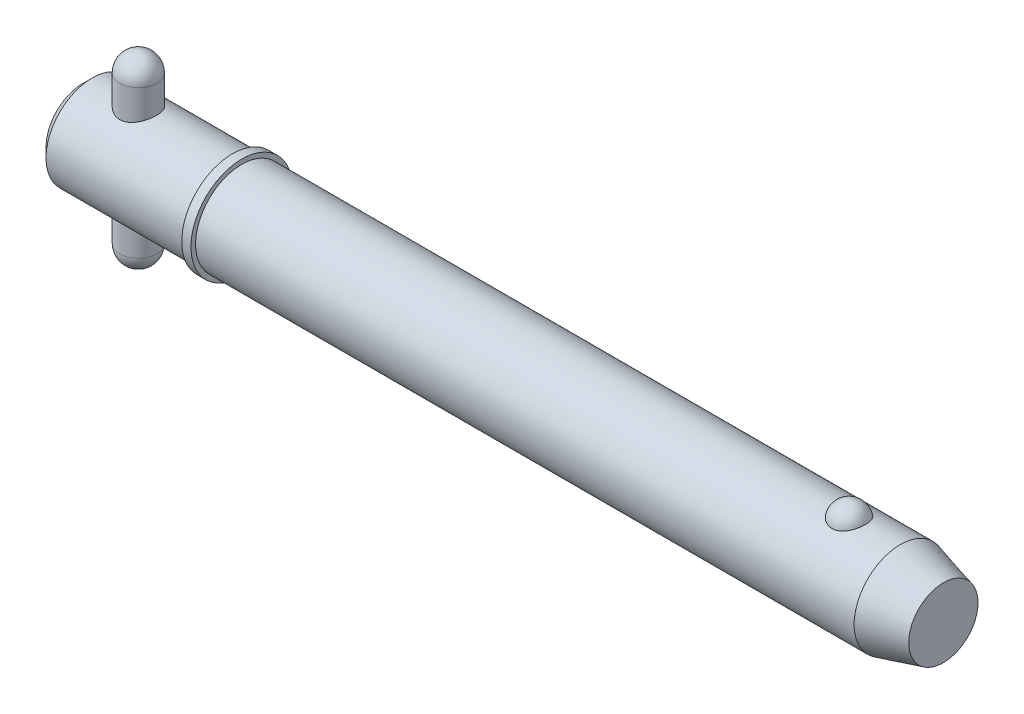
ISO-10303-21;
HEADER;
FILE_DESCRIPTION(('STEP AP214'),'2;1');
FILE_NAME('part.step','',(''),(''),'','','');
FILE_SCHEMA(('AUTOMOTIVE_DESIGN { 1 0 10303 214 1 1 1 1 }'));
ENDSEC;
DATA;
#1=APPLICATION_CONTEXT('core data for automotive mechanical design processes');
#2=APPLICATION_PROTOCOL_DEFINITION('international standard','automotive_design',2000,#1);
#3=PRODUCT_CONTEXT('',#1,'mechanical');
#4=PRODUCT('Part','Part','',(#3));
#5=PRODUCT_RELATED_PRODUCT_CATEGORY('part','',(#4));
#6=PRODUCT_DEFINITION_FORMATION('','',#4);
#7=PRODUCT_DEFINITION_CONTEXT('part definition',#1,'design');
#8=PRODUCT_DEFINITION('design','',#6,#7);
#9=PRODUCT_DEFINITION_SHAPE('','',#8);
#10=(LENGTH_UNIT() NAMED_UNIT(*) SI_UNIT(.MILLI.,.METRE.));
#11=(NAMED_UNIT(*) PLANE_ANGLE_UNIT() SI_UNIT($,.RADIAN.));
#12=(NAMED_UNIT(*) SI_UNIT($,.STERADIAN.) SOLID_ANGLE_UNIT());
#13=UNCERTAINTY_MEASURE_WITH_UNIT(LENGTH_MEASURE(1.E-05),#10,'distance_accuracy_value','');
#14=(GEOMETRIC_REPRESENTATION_CONTEXT(3) GLOBAL_UNCERTAINTY_ASSIGNED_CONTEXT((#13)) GLOBAL_UNIT_ASSIGNED_CONTEXT((#10,
#11,#12)) REPRESENTATION_CONTEXT('',''));
#15=CARTESIAN_POINT('',(0.,0.,0.));
#16=DIRECTION('',(0.,0.,1.));
#17=DIRECTION('',(1.,0.,0.));
#18=AXIS2_PLACEMENT_3D('',#15,#16,#17);
#19=CARTESIAN_POINT('',(9.525,15.875,0.));
#20=DIRECTION('',(0.,-1.,0.));
#21=DIRECTION('',(0.,0.,-1.));
#22=AXIS2_PLACEMENT_3D('',#19,#20,#21);
#23=CYLINDRICAL_SURFACE('',#22,3.175);
#24=CARTESIAN_POINT('',(9.525,-12.7,0.));
#25=DIRECTION('',(0.,-1.,0.));
#26=DIRECTION('',(0.,0.,-1.));
#27=AXIS2_PLACEMENT_3D('',#24,#25,#26);
#28=CIRCLE('',#27,3.175);
#29=CARTESIAN_POINT('',(9.525,-12.7,-3.175));
#30=VERTEX_POINT('',#29);
#31=EDGE_CURVE('P0_E10',#30,#30,#28,.F.);
#32=ORIENTED_EDGE('',*,*,#31,.T.);
#33=EDGE_LOOP('',(#32));
#34=FACE_BOUND('',#33,.T.);
#35=CARTESIAN_POINT('',(9.525,12.7,0.));
#36=DIRECTION('',(0.,-1.,0.));
#37=DIRECTION('',(0.,0.,-1.));
#38=AXIS2_PLACEMENT_3D('',#35,#36,#37);
#39=CIRCLE('',#38,3.175);
#40=CARTESIAN_POINT('',(9.525,12.7,-3.175));
#41=VERTEX_POINT('',#40);
#42=EDGE_CURVE('P0_E21',#41,#41,#39,.T.);
#43=ORIENTED_EDGE('',*,*,#42,.T.);
#44=EDGE_LOOP('',(#43));
#45=FACE_BOUND('',#44,.T.);
#46=ADVANCED_FACE('P0_F14',(#34,#45),#23,.T.);
#47=CARTESIAN_POINT('',(9.525,-12.7,0.));
#48=DIRECTION('',(0.,0.,1.));
#49=DIRECTION('',(1.,0.,0.));
#50=AXIS2_PLACEMENT_3D('',#47,#48,#49);
#51=SPHERICAL_SURFACE('',#50,3.175);
#52=CARTESIAN_POINT('',(9.525,-12.7,0.));
#53=DIRECTION('',(0.,-1.,0.));
#54=DIRECTION('',(0.,0.,-1.));
#55=AXIS2_PLACEMENT_3D('',#52,#53,#54);
#56=SPHERICAL_SURFACE('',#55,3.175);
#57=ORIENTED_EDGE('',*,*,#31,.F.);
#58=EDGE_LOOP('',(#57));
#59=FACE_BOUND('',#58,.T.);
#60=ADVANCED_FACE('P0_F29',(#59),#56,.T.);
#61=CARTESIAN_POINT('',(9.525,12.7,0.));
#62=DIRECTION('',(0.,0.,1.));
#63=DIRECTION('',(1.,0.,0.));
#64=AXIS2_PLACEMENT_3D('',#61,#62,#63);
#65=SPHERICAL_SURFACE('',#64,3.175);
#66=CARTESIAN_POINT('',(9.525,12.7,0.));
#67=DIRECTION('',(0.,-1.,0.));
#68=DIRECTION('',(0.,0.,-1.));
#69=AXIS2_PLACEMENT_3D('',#66,#67,#68);
#70=SPHERICAL_SURFACE('',#69,3.175);
#71=ORIENTED_EDGE('',*,*,#42,.F.);
#72=EDGE_LOOP('',(#71));
#73=FACE_BOUND('',#72,.T.);
#74=ADVANCED_FACE('P0_F16',(#73),#70,.T.);
#75=CLOSED_SHELL('',(#46,#60,#74));
#76=MANIFOLD_SOLID_BREP('P0_B1',#75);
#77=CARTESIAN_POINT('',(0.,0.,0.));
#78=DIRECTION('',(1.,0.,0.));
#79=DIRECTION('',(0.,0.,-1.));
#80=AXIS2_PLACEMENT_3D('',#77,#78,#79);
#81=CYLINDRICAL_SURFACE('',#80,7.94);
#82=CARTESIAN_POINT('',(140.551879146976,0.,0.));
#83=DIRECTION('',(1.,0.,0.));
#84=DIRECTION('',(0.,0.,-1.));
#85=AXIS2_PLACEMENT_3D('',#82,#83,#84);
#86=CIRCLE('',#85,7.94);
#87=CARTESIAN_POINT('',(140.551879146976,0.,-7.94));
#88=VERTEX_POINT('',#87);
#89=EDGE_CURVE('P1_E81',#88,#88,#86,.T.);
#90=ORIENTED_EDGE('',*,*,#89,.F.);
#91=EDGE_LOOP('',(#90));
#92=FACE_BOUND('',#91,.T.);
#93=CARTESIAN_POINT('',(27.31,0.,0.));
#94=DIRECTION('',(1.,0.,0.));
#95=DIRECTION('',(0.,0.,-1.));
#96=AXIS2_PLACEMENT_3D('',#93,#94,#95);
#97=CIRCLE('',#96,7.94);
#98=CARTESIAN_POINT('',(27.31,0.,-7.94));
#99=VERTEX_POINT('',#98);
#100=EDGE_CURVE('P1_E85',#99,#99,#97,.T.);
#101=ORIENTED_EDGE('',*,*,#100,.T.);
#102=EDGE_LOOP('',(#101));
#103=FACE_BOUND('',#102,.T.);
#104=CARTESIAN_POINT('',(131.744907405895,7.37767842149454,2.93486986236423));
#105=CARTESIAN_POINT('',(131.592749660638,7.3776732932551,2.93487505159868));
#106=CARTESIAN_POINT('',(131.440632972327,7.38258419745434,2.92262454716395));
#107=CARTESIAN_POINT('',(131.140928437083,7.40163229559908,2.87404196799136));
#108=CARTESIAN_POINT('',(130.993339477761,7.41576720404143,2.83771585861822));
#109=CARTESIAN_POINT('',(130.707018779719,7.45161576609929,2.74218769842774));
#110=CARTESIAN_POINT('',(130.568274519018,7.47331841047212,2.68301886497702));
#111=CARTESIAN_POINT('',(130.302882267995,7.52194082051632,2.54350967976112));
#112=CARTESIAN_POINT('',(130.176236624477,7.54886159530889,2.46316523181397));
#113=CARTESIAN_POINT('',(129.934534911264,7.60594671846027,2.28090375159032));
#114=CARTESIAN_POINT('',(129.819906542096,7.63618114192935,2.1784421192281));
#115=CARTESIAN_POINT('',(129.608878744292,7.69614046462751,1.95608495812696));
#116=CARTESIAN_POINT('',(129.512482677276,7.72586526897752,1.83618622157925));
#117=CARTESIAN_POINT('',(129.335938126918,7.78314821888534,1.57628086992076));
#118=CARTESIAN_POINT('',(129.256707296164,7.81055035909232,1.43561546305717));
#119=CARTESIAN_POINT('',(129.121797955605,7.85879631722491,1.14236334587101));
#120=CARTESIAN_POINT('',(129.066121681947,7.87963951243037,0.989775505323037));
#121=CARTESIAN_POINT('',(128.97881215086,7.91289645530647,0.674619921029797));
#122=CARTESIAN_POINT('',(128.94753090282,7.92518652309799,0.511941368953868));
#123=CARTESIAN_POINT('',(128.910975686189,7.93958930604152,0.183247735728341));
#124=CARTESIAN_POINT('',(128.905701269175,7.94170219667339,0.0172327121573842));
#125=CARTESIAN_POINT('',(128.921231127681,7.93554931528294,-0.312672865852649));
#126=CARTESIAN_POINT('',(128.941925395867,7.92732732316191,-0.476569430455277));
#127=CARTESIAN_POINT('',(129.00878655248,7.90141534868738,-0.79830524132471));
#128=CARTESIAN_POINT('',(129.054953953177,7.88372517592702,-0.956144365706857));
#129=CARTESIAN_POINT('',(129.171898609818,7.84066230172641,-1.26152073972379));
#130=CARTESIAN_POINT('',(129.242704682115,7.81528060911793,-1.40904568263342));
#131=CARTESIAN_POINT('',(129.407478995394,7.75948672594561,-1.68950598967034));
#132=CARTESIAN_POINT('',(129.501448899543,7.72907417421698,-1.82244030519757));
#133=CARTESIAN_POINT('',(129.710839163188,7.66640424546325,-2.07032792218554));
#134=CARTESIAN_POINT('',(129.826315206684,7.63414223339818,-2.18523308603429));
#135=CARTESIAN_POINT('',(130.0759006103,7.57149681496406,-2.39329737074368));
#136=CARTESIAN_POINT('',(130.210008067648,7.54111321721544,-2.48645870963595));
#137=CARTESIAN_POINT('',(130.490111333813,7.48650742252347,-2.64628132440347));
#138=CARTESIAN_POINT('',(130.635760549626,7.46215900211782,-2.71350554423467));
#139=CARTESIAN_POINT('',(130.937425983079,7.42171253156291,-2.82226614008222));
#140=CARTESIAN_POINT('',(131.093438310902,7.40561140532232,-2.86381209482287));
#141=CARTESIAN_POINT('',(131.402970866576,7.3842679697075,-2.9183907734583));
#142=CARTESIAN_POINT('',(131.556222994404,7.37852109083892,-2.93275024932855));
#143=CARTESIAN_POINT('',(131.863070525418,7.37700973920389,-2.93655208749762));
#144=CARTESIAN_POINT('',(132.016665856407,7.38124333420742,-2.92599927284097));
#145=CARTESIAN_POINT('',(132.314990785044,7.39890635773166,-2.88102897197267));
#146=CARTESIAN_POINT('',(132.459848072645,7.41205491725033,-2.84733999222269));
#147=CARTESIAN_POINT('',(132.74164329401,7.445801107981,-2.75788206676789));
#148=CARTESIAN_POINT('',(132.878580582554,7.46639934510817,-2.70211132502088));
#149=CARTESIAN_POINT('',(133.144061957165,7.51339098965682,-2.56858908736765));
#150=CARTESIAN_POINT('',(133.272354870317,7.53990200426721,-2.4903806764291));
#151=CARTESIAN_POINT('',(133.514244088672,7.59569503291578,-2.31462737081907));
#152=CARTESIAN_POINT('',(133.627837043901,7.6249776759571,-2.21707808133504));
#153=CARTESIAN_POINT('',(133.84322156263,7.68489473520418,-1.99982049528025));
#154=CARTESIAN_POINT('',(133.944148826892,7.71552419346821,-1.87925337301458));
#155=CARTESIAN_POINT('',(134.125186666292,7.77353016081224,-1.6226882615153));
#156=CARTESIAN_POINT('',(134.205293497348,7.80090608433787,-1.48668750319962));
#157=CARTESIAN_POINT('',(134.345361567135,7.85047992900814,-1.1981841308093));
#158=CARTESIAN_POINT('',(134.404587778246,7.87248183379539,-1.04529016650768));
#159=CARTESIAN_POINT('',(134.497982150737,7.90785114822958,-0.731080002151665));
#160=CARTESIAN_POINT('',(134.532149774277,7.92121837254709,-0.569763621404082));
#161=CARTESIAN_POINT('',(134.574795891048,7.93797834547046,-0.242812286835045));
#162=CARTESIAN_POINT('',(134.583204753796,7.94134405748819,-0.0771668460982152));
#163=CARTESIAN_POINT('',(134.573962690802,7.93767937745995,0.253276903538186));
#164=CARTESIAN_POINT('',(134.556312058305,7.93064910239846,0.418075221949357));
#165=CARTESIAN_POINT('',(134.495424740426,7.90695571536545,0.741525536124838));
#166=CARTESIAN_POINT('',(134.452281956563,7.8903279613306,0.900197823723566));
#167=CARTESIAN_POINT('',(134.34135358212,7.84916386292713,1.20759654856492));
#168=CARTESIAN_POINT('',(134.27356656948,7.82462706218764,1.35632241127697));
#169=CARTESIAN_POINT('',(134.114371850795,7.77006699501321,1.64032869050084));
#170=CARTESIAN_POINT('',(134.022861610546,7.74002008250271,1.7755471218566));
#171=CARTESIAN_POINT('',(133.818296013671,7.67774175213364,2.0280064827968));
#172=CARTESIAN_POINT('',(133.705241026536,7.64551037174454,2.14524772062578));
#173=CARTESIAN_POINT('',(133.460831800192,7.58265895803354,2.35778002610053));
#174=CARTESIAN_POINT('',(133.329583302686,7.5520309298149,2.45319004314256));
#175=CARTESIAN_POINT('',(133.051601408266,7.49579792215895,2.61999897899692));
#176=CARTESIAN_POINT('',(132.904867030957,7.4701932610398,2.69139637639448));
#177=CARTESIAN_POINT('',(132.592947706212,7.42622216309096,2.8105324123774));
#178=CARTESIAN_POINT('',(132.427220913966,7.40825002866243,2.85700910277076));
#179=CARTESIAN_POINT('',(132.089279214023,7.38398348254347,2.9191685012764));
#180=CARTESIAN_POINT('',(131.91706702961,7.3776842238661,2.93486399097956));
#181=CARTESIAN_POINT('',(131.744907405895,7.37767842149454,2.93486986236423));
#182=B_SPLINE_CURVE_WITH_KNOTS('',3,(#104,#105,#106,#107,#108,#109,#110,#111,#112,#113,#114,
#115,#116,#117,#118,#119,#120,#121,#122,#123,#124,#125,#126,#127,#128,#129,#130,#131,#132,#133,
#134,#135,#136,#137,#138,#139,#140,#141,#142,#143,#144,#145,#146,#147,#148,#149,#150,#151,#152,
#153,#154,#155,#156,#157,#158,#159,#160,#161,#162,#163,#164,#165,#166,#167,#168,#169,#170,#171,
#172,#173,#174,#175,#176,#177,#178,#179,#180,#181),.UNSPECIFIED.,.T.,.F.,(4,2,2,2,2,2,2,2,2,2,2,
2,2,2,2,2,2,2,2,2,2,2,2,2,2,2,2,2,2,2,2,2,2,2,2,2,2,2,4),(0.,0.455841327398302,
0.911569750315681,1.36663794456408,1.82179423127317,2.2897898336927,2.75787163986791,
3.24685368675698,3.73588214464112,4.23184282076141,4.72779494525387,5.22165321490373,
5.71552141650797,6.20996917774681,6.7044524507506,7.20023431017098,7.69596557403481,
8.18023418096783,8.66432203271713,9.12410697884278,9.58380291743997,10.0296503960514,
10.4755341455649,10.9312349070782,11.3870393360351,11.8654416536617,12.3439299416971,
12.8378875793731,13.3318558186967,13.8271581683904,14.3224549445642,14.8159385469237,
15.3094506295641,15.8051323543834,16.3008055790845,16.7937101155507,17.2866458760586,
17.8026240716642,18.3183879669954),.UNSPECIFIED.);
#183=CARTESIAN_POINT('',(131.744907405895,7.37767842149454,2.93486986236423));
#184=VERTEX_POINT('',#183);
#185=EDGE_CURVE('P1_E35',#184,#184,#182,.T.);
#186=ORIENTED_EDGE('',*,*,#185,.T.);
#187=EDGE_LOOP('',(#186));
#188=FACE_BOUND('',#187,.T.);
#189=ADVANCED_FACE('P1_F13',(#92,#103,#188),#81,.T.);
#190=CARTESIAN_POINT('',(0.,0.,0.));
#191=DIRECTION('',(-1.,0.,0.));
#192=DIRECTION('',(0.,0.,1.));
#193=AXIS2_PLACEMENT_3D('',#190,#191,#192);
#194=PLANE('',#193);
#195=CARTESIAN_POINT('',(0.,0.,0.));
#196=DIRECTION('',(1.,0.,0.));
#197=DIRECTION('',(0.,0.,-1.));
#198=AXIS2_PLACEMENT_3D('',#195,#196,#197);
#199=CIRCLE('',#198,6.352);
#200=CARTESIAN_POINT('',(0.,0.,-6.352));
#201=VERTEX_POINT('',#200);
#202=EDGE_CURVE('P1_E9',#201,#201,#199,.T.);
#203=ORIENTED_EDGE('',*,*,#202,.F.);
#204=EDGE_LOOP('',(#203));
#205=FACE_BOUND('',#204,.T.);
#206=ADVANCED_FACE('P1_F15',(#205),#194,.T.);
#207=CARTESIAN_POINT('',(1.58799999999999,0.,0.));
#208=DIRECTION('',(1.,0.,0.));
#209=DIRECTION('',(0.,0.,-1.));
#210=AXIS2_PLACEMENT_3D('',#207,#208,#209);
#211=CONICAL_SURFACE('',#210,7.94,0.78539816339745);
#212=ORIENTED_EDGE('',*,*,#202,.T.);
#213=EDGE_LOOP('',(#212));
#214=FACE_BOUND('',#213,.T.);
#215=CARTESIAN_POINT('',(1.58799999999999,0.,0.));
#216=DIRECTION('',(1.,0.,0.));
#217=DIRECTION('',(0.,0.,-1.));
#218=AXIS2_PLACEMENT_3D('',#215,#216,#217);
#219=CIRCLE('',#218,7.94);
#220=CARTESIAN_POINT('',(1.58799999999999,0.,-7.94));
#221=VERTEX_POINT('',#220);
#222=EDGE_CURVE('P1_E26',#221,#221,#219,.T.);
#223=ORIENTED_EDGE('',*,*,#222,.F.);
#224=EDGE_LOOP('',(#223));
#225=FACE_BOUND('',#224,.T.);
#226=ADVANCED_FACE('P1_F77',(#214,#225),#211,.T.);
#227=CARTESIAN_POINT('',(0.,0.,0.));
#228=DIRECTION('',(1.,0.,0.));
#229=DIRECTION('',(0.,0.,-1.));
#230=AXIS2_PLACEMENT_3D('',#227,#228,#229);
#231=CYLINDRICAL_SURFACE('',#230,7.94);
#232=CARTESIAN_POINT('',(9.525,-7.27756655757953,3.175));
#233=CARTESIAN_POINT('',(9.43992346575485,-7.27756715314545,3.17499935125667));
#234=CARTESIAN_POINT('',(9.35481882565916,-7.27906496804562,3.1715736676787));
#235=CARTESIAN_POINT('',(9.18524505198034,-7.28499816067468,3.15791803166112));
#236=CARTESIAN_POINT('',(9.100776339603,-7.28943533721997,3.14768391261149));
#237=CARTESIAN_POINT('',(8.84895715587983,-7.30698881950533,3.10684226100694));
#238=CARTESIAN_POINT('',(8.6834173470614,-7.32434654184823,3.06609574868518));
#239=CARTESIAN_POINT('',(8.36278910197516,-7.36806950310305,2.95945910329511));
#240=CARTESIAN_POINT('',(8.20766386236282,-7.39440078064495,2.89366366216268));
#241=CARTESIAN_POINT('',(7.91065319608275,-7.45304562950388,2.73907413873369));
#242=CARTESIAN_POINT('',(7.76876488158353,-7.48535789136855,2.65028508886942));
#243=CARTESIAN_POINT('',(7.49411086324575,-7.55439482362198,2.44679888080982));
#244=CARTESIAN_POINT('',(7.36219910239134,-7.59126138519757,2.33099745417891));
#245=CARTESIAN_POINT('',(7.11904234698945,-7.66408045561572,2.07909838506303));
#246=CARTESIAN_POINT('',(7.00780457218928,-7.70003264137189,1.94299368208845));
#247=CARTESIAN_POINT('',(6.80492173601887,-7.76867514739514,1.64775981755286));
#248=CARTESIAN_POINT('',(6.71422139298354,-7.80118112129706,1.48793473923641));
#249=CARTESIAN_POINT('',(6.56135788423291,-7.85754918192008,1.15376269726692));
#250=CARTESIAN_POINT('',(6.49918311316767,-7.88141478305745,0.979421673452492));
#251=CARTESIAN_POINT('',(6.40818142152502,-7.91680873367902,0.630115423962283));
#252=CARTESIAN_POINT('',(6.3778864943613,-7.9288781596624,0.455588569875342));
#253=CARTESIAN_POINT('',(6.34677743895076,-7.94127547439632,0.103539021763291));
#254=CARTESIAN_POINT('',(6.34595232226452,-7.94160773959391,-0.0739825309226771));
#255=CARTESIAN_POINT('',(6.37300128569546,-7.93082261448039,-0.416371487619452));
#256=CARTESIAN_POINT('',(6.39926693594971,-7.92034690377,-0.581389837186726));
#257=CARTESIAN_POINT('',(6.47701615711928,-7.88998770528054,-0.904449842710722));
#258=CARTESIAN_POINT('',(6.52850157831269,-7.87010352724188,-1.06249098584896));
#259=CARTESIAN_POINT('',(6.65586120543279,-7.82249343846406,-1.36995769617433));
#260=CARTESIAN_POINT('',(6.73209124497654,-7.79465387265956,-1.51921754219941));
#261=CARTESIAN_POINT('',(6.90644286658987,-7.73389606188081,-1.80321183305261));
#262=CARTESIAN_POINT('',(7.00457194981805,-7.70097607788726,-1.93794127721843));
#263=CARTESIAN_POINT('',(7.22744086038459,-7.63084889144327,-2.19843606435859));
#264=CARTESIAN_POINT('',(7.35350432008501,-7.59350211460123,-2.3230330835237));
#265=CARTESIAN_POINT('',(7.62488266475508,-7.52039654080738,-2.54979642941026));
#266=CARTESIAN_POINT('',(7.77020381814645,-7.48463826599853,-2.65195542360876));
#267=CARTESIAN_POINT('',(8.08119298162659,-7.41780943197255,-2.83361305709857));
#268=CARTESIAN_POINT('',(8.24731937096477,-7.38689959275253,-2.91239105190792));
#269=CARTESIAN_POINT('',(8.59204539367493,-7.33515216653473,-3.04038913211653));
#270=CARTESIAN_POINT('',(8.77063684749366,-7.31430804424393,-3.08962840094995));
#271=CARTESIAN_POINT('',(9.12356982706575,-7.28663831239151,-3.15431018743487));
#272=CARTESIAN_POINT('',(9.29750494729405,-7.2790344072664,-3.17163284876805));
#273=CARTESIAN_POINT('',(9.64592502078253,-7.27648884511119,-3.17747282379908));
#274=CARTESIAN_POINT('',(9.82040979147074,-7.28154335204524,-3.16599886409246));
#275=CARTESIAN_POINT('',(10.1545374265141,-7.30294638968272,-3.11628310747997));
#276=CARTESIAN_POINT('',(10.3144598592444,-7.31863587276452,-3.0796016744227));
#277=CARTESIAN_POINT('',(10.625774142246,-7.35872371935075,-2.98253618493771));
#278=CARTESIAN_POINT('',(10.7771640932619,-7.38312401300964,-2.92214687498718));
#279=CARTESIAN_POINT('',(11.0739599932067,-7.4390944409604,-2.77664664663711));
#280=CARTESIAN_POINT('',(11.2188745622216,-7.47091513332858,-2.69063278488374));
#281=CARTESIAN_POINT('',(11.4928722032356,-7.53775867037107,-2.49724834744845));
#282=CARTESIAN_POINT('',(11.6219487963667,-7.57278281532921,-2.38986907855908));
#283=CARTESIAN_POINT('',(11.8705091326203,-7.64520845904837,-2.1474449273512));
#284=CARTESIAN_POINT('',(11.9885816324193,-7.68259462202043,-2.01094304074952));
#285=CARTESIAN_POINT('',(12.2003631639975,-7.75309951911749,-1.71917041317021));
#286=CARTESIAN_POINT('',(12.2940712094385,-7.78621808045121,-1.56389891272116));
#287=CARTESIAN_POINT('',(12.4541161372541,-7.84456050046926,-1.23845027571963));
#288=CARTESIAN_POINT('',(12.5204600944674,-7.86978639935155,-1.06827700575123));
#289=CARTESIAN_POINT('',(12.6231407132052,-7.90943635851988,-0.717928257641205));
#290=CARTESIAN_POINT('',(12.6594936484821,-7.92386627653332,-0.537758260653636));
#291=CARTESIAN_POINT('',(12.6992281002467,-7.93967263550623,-0.185201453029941));
#292=CARTESIAN_POINT('',(12.7046050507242,-7.94183891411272,-0.0130732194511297));
#293=CARTESIAN_POINT('',(12.6875036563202,-7.9350072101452,0.329549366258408));
#294=CARTESIAN_POINT('',(12.6650295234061,-7.92601091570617,0.500043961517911));
#295=CARTESIAN_POINT('',(12.5942896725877,-7.89825976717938,0.829196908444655));
#296=CARTESIAN_POINT('',(12.5468364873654,-7.87981280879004,0.988057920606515));
#297=CARTESIAN_POINT('',(12.4283390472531,-7.83513565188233,1.29553461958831));
#298=CARTESIAN_POINT('',(12.3572904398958,-7.8089040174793,1.44414841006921));
#299=CARTESIAN_POINT('',(12.1900822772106,-7.7497911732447,1.73412879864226));
#300=CARTESIAN_POINT('',(12.0929519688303,-7.71666737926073,1.87488510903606));
#301=CARTESIAN_POINT('',(11.8777894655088,-7.64775894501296,2.13869231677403));
#302=CARTESIAN_POINT('',(11.7597486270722,-7.61197320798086,2.26173585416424));
#303=CARTESIAN_POINT('',(11.4974896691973,-7.53902341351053,2.49449755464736));
#304=CARTESIAN_POINT('',(11.3521039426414,-7.50191102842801,2.60292060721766));
#305=CARTESIAN_POINT('',(11.0440201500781,-7.43289551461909,2.79392602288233));
#306=CARTESIAN_POINT('',(10.8813200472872,-7.40099299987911,2.87650534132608));
#307=CARTESIAN_POINT('',(10.558064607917,-7.3489506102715,3.00682739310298));
#308=CARTESIAN_POINT('',(10.398627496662,-7.32801197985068,3.05703164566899));
#309=CARTESIAN_POINT('',(10.0731242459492,-7.29639491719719,3.13175843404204));
#310=CARTESIAN_POINT('',(9.90707793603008,-7.28568789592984,3.15635254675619));
#311=CARTESIAN_POINT('',(9.70441566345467,-7.27968826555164,3.17013149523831));
#312=CARTESIAN_POINT('',(9.66856669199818,-7.27889378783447,3.17195593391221));
#313=CARTESIAN_POINT('',(9.59681348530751,-7.27783278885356,3.17439036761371));
#314=CARTESIAN_POINT('',(9.56090924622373,-7.27756630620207,3.17500027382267));
#315=CARTESIAN_POINT('',(9.525,-7.27756655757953,3.175));
#316=B_SPLINE_CURVE_WITH_KNOTS('',3,(#232,#233,#234,#235,#236,#237,#238,#239,#240,#241,#242,
#243,#244,#245,#246,#247,#248,#249,#250,#251,#252,#253,#254,#255,#256,#257,#258,#259,#260,#261,
#262,#263,#264,#265,#266,#267,#268,#269,#270,#271,#272,#273,#274,#275,#276,#277,#278,#279,#280,
#281,#282,#283,#284,#285,#286,#287,#288,#289,#290,#291,#292,#293,#294,#295,#296,#297,#298,#299,
#300,#301,#302,#303,#304,#305,#306,#307,#308,#309,#310,#311,#312,#313,#314,#315),.UNSPECIFIED.,
.T.,.F.,(4,2,2,2,2,2,2,2,2,2,2,2,2,2,2,2,2,2,2,2,2,2,2,2,2,2,2,2,2,2,2,2,2,2,2,2,2,2,2,2,2,4),
(0.,0.255187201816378,0.510530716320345,1.0218798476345,1.53131482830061,2.04063840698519,
2.57635929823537,3.11226692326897,3.66929090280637,4.22608806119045,4.75594400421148,
5.28560237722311,5.78552836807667,6.28549104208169,6.79298787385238,7.30065880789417,
7.8416422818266,8.38280228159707,8.93923025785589,9.49529647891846,10.0174074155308,
10.5393601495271,11.0316114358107,11.5239718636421,12.0362920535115,12.5488211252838,
13.0991799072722,13.6495609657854,14.1997996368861,14.7497395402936,15.2638187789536,
15.7778202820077,16.2760504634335,16.7743726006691,17.294711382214,17.8152657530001,
18.3680208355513,18.9208410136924,19.4240423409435,19.9258334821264,20.0335354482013,
20.1412452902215),.UNSPECIFIED.);
#317=CARTESIAN_POINT('',(9.525,-7.27756655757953,3.175));
#318=VERTEX_POINT('',#317);
#319=EDGE_CURVE('P1_E17',#318,#318,#316,.T.);
#320=ORIENTED_EDGE('',*,*,#319,.F.);
#321=EDGE_LOOP('',(#320));
#322=FACE_BOUND('',#321,.T.);
#323=CARTESIAN_POINT('',(9.525,7.27756655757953,3.175));
#324=CARTESIAN_POINT('',(9.61007653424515,7.27756715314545,3.17499935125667));
#325=CARTESIAN_POINT('',(9.69518117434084,7.27906496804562,3.1715736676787));
#326=CARTESIAN_POINT('',(9.86475494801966,7.28499816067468,3.15791803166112));
#327=CARTESIAN_POINT('',(9.949223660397,7.28943533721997,3.14768391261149));
#328=CARTESIAN_POINT('',(10.2010428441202,7.30698881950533,3.10684226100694));
#329=CARTESIAN_POINT('',(10.3665826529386,7.32434654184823,3.06609574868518));
#330=CARTESIAN_POINT('',(10.6872108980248,7.36806950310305,2.95945910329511));
#331=CARTESIAN_POINT('',(10.8423361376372,7.39440078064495,2.89366366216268));
#332=CARTESIAN_POINT('',(11.1393468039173,7.45304562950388,2.73907413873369));
#333=CARTESIAN_POINT('',(11.2812351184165,7.48535789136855,2.65028508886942));
#334=CARTESIAN_POINT('',(11.5558891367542,7.55439482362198,2.44679888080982));
#335=CARTESIAN_POINT('',(11.6878008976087,7.59126138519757,2.33099745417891));
#336=CARTESIAN_POINT('',(11.9309576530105,7.66408045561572,2.07909838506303));
#337=CARTESIAN_POINT('',(12.0421954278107,7.70003264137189,1.94299368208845));
#338=CARTESIAN_POINT('',(12.2450782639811,7.76867514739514,1.64775981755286));
#339=CARTESIAN_POINT('',(12.3357786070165,7.80118112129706,1.48793473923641));
#340=CARTESIAN_POINT('',(12.4886421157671,7.85754918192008,1.15376269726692));
#341=CARTESIAN_POINT('',(12.5508168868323,7.88141478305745,0.979421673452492));
#342=CARTESIAN_POINT('',(12.641818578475,7.91680873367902,0.630115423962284));
#343=CARTESIAN_POINT('',(12.6721135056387,7.9288781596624,0.455588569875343));
#344=CARTESIAN_POINT('',(12.7032225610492,7.94127547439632,0.103539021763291));
#345=CARTESIAN_POINT('',(12.7040476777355,7.94160773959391,-0.0739825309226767));
#346=CARTESIAN_POINT('',(12.6769987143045,7.93082261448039,-0.416371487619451));
#347=CARTESIAN_POINT('',(12.6507330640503,7.92034690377,-0.581389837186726));
#348=CARTESIAN_POINT('',(12.5729838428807,7.88998770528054,-0.904449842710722));
#349=CARTESIAN_POINT('',(12.5214984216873,7.87010352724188,-1.06249098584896));
#350=CARTESIAN_POINT('',(12.3941387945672,7.82249343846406,-1.36995769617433));
#351=CARTESIAN_POINT('',(12.3179087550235,7.79465387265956,-1.51921754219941));
#352=CARTESIAN_POINT('',(12.1435571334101,7.73389606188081,-1.80321183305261));
#353=CARTESIAN_POINT('',(12.0454280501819,7.70097607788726,-1.93794127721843));
#354=CARTESIAN_POINT('',(11.8225591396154,7.63084889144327,-2.19843606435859));
#355=CARTESIAN_POINT('',(11.696495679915,7.59350211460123,-2.3230330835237));
#356=CARTESIAN_POINT('',(11.4251173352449,7.52039654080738,-2.54979642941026));
#357=CARTESIAN_POINT('',(11.2797961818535,7.48463826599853,-2.65195542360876));
#358=CARTESIAN_POINT('',(10.9688070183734,7.41780943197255,-2.83361305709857));
#359=CARTESIAN_POINT('',(10.8026806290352,7.38689959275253,-2.91239105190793));
#360=CARTESIAN_POINT('',(10.4579546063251,7.33515216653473,-3.04038913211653));
#361=CARTESIAN_POINT('',(10.2793631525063,7.31430804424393,-3.08962840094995));
#362=CARTESIAN_POINT('',(9.92643017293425,7.28663831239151,-3.15431018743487));
#363=CARTESIAN_POINT('',(9.75249505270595,7.2790344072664,-3.17163284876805));
#364=CARTESIAN_POINT('',(9.40407497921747,7.2764888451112,-3.17747282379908));
#365=CARTESIAN_POINT('',(9.22959020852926,7.28154335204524,-3.16599886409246));
#366=CARTESIAN_POINT('',(8.89546257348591,7.30294638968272,-3.11628310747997));
#367=CARTESIAN_POINT('',(8.73554014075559,7.31863587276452,-3.0796016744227));
#368=CARTESIAN_POINT('',(8.42422585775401,7.35872371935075,-2.98253618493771));
#369=CARTESIAN_POINT('',(8.27283590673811,7.38312401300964,-2.92214687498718));
#370=CARTESIAN_POINT('',(7.97604000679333,7.4390944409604,-2.77664664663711));
#371=CARTESIAN_POINT('',(7.83112543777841,7.47091513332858,-2.69063278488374));
#372=CARTESIAN_POINT('',(7.55712779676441,7.53775867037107,-2.49724834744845));
#373=CARTESIAN_POINT('',(7.42805120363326,7.57278281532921,-2.38986907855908));
#374=CARTESIAN_POINT('',(7.17949086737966,7.64520845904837,-2.1474449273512));
#375=CARTESIAN_POINT('',(7.06141836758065,7.68259462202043,-2.01094304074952));
#376=CARTESIAN_POINT('',(6.8496368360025,7.75309951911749,-1.71917041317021));
#377=CARTESIAN_POINT('',(6.75592879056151,7.78621808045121,-1.56389891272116));
#378=CARTESIAN_POINT('',(6.59588386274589,7.84456050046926,-1.23845027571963));
#379=CARTESIAN_POINT('',(6.52953990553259,7.86978639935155,-1.06827700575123));
#380=CARTESIAN_POINT('',(6.42685928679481,7.90943635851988,-0.717928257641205));
#381=CARTESIAN_POINT('',(6.39050635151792,7.92386627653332,-0.537758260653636));
#382=CARTESIAN_POINT('',(6.35077189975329,7.93967263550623,-0.18520145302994));
#383=CARTESIAN_POINT('',(6.34539494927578,7.94183891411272,-0.0130732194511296));
#384=CARTESIAN_POINT('',(6.36249634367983,7.9350072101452,0.329549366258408));
#385=CARTESIAN_POINT('',(6.38497047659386,7.92601091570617,0.500043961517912));
#386=CARTESIAN_POINT('',(6.45571032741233,7.89825976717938,0.829196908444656));
#387=CARTESIAN_POINT('',(6.50316351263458,7.87981280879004,0.988057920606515));
#388=CARTESIAN_POINT('',(6.62166095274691,7.83513565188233,1.29553461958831));
#389=CARTESIAN_POINT('',(6.69270956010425,7.8089040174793,1.44414841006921));
#390=CARTESIAN_POINT('',(6.85991772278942,7.7497911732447,1.73412879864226));
#391=CARTESIAN_POINT('',(6.95704803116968,7.71666737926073,1.87488510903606));
#392=CARTESIAN_POINT('',(7.17221053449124,7.64775894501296,2.13869231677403));
#393=CARTESIAN_POINT('',(7.29025137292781,7.61197320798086,2.26173585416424));
#394=CARTESIAN_POINT('',(7.55251033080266,7.53902341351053,2.49449755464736));
#395=CARTESIAN_POINT('',(7.69789605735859,7.50191102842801,2.60292060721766));
#396=CARTESIAN_POINT('',(8.00597984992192,7.43289551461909,2.79392602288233));
#397=CARTESIAN_POINT('',(8.16867995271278,7.40099299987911,2.87650534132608));
#398=CARTESIAN_POINT('',(8.49193539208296,7.3489506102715,3.00682739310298));
#399=CARTESIAN_POINT('',(8.65137250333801,7.32801197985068,3.05703164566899));
#400=CARTESIAN_POINT('',(8.97687575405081,7.29639491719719,3.13175843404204));
#401=CARTESIAN_POINT('',(9.14292206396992,7.28568789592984,3.15635254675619));
#402=CARTESIAN_POINT('',(9.34558433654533,7.27968826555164,3.17013149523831));
#403=CARTESIAN_POINT('',(9.38143330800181,7.27889378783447,3.17195593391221));
#404=CARTESIAN_POINT('',(9.45318651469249,7.27783278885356,3.17439036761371));
#405=CARTESIAN_POINT('',(9.48909075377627,7.27756630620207,3.17500027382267));
#406=CARTESIAN_POINT('',(9.525,7.27756655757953,3.175));
#407=B_SPLINE_CURVE_WITH_KNOTS('',3,(#323,#324,#325,#326,#327,#328,#329,#330,#331,#332,#333,
#334,#335,#336,#337,#338,#339,#340,#341,#342,#343,#344,#345,#346,#347,#348,#349,#350,#351,#352,
#353,#354,#355,#356,#357,#358,#359,#360,#361,#362,#363,#364,#365,#366,#367,#368,#369,#370,#371,
#372,#373,#374,#375,#376,#377,#378,#379,#380,#381,#382,#383,#384,#385,#386,#387,#388,#389,#390,
#391,#392,#393,#394,#395,#396,#397,#398,#399,#400,#401,#402,#403,#404,#405,#406),.UNSPECIFIED.,
.T.,.F.,(4,2,2,2,2,2,2,2,2,2,2,2,2,2,2,2,2,2,2,2,2,2,2,2,2,2,2,2,2,2,2,2,2,2,2,2,2,2,2,2,2,4),
(0.,0.255187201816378,0.510530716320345,1.0218798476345,1.53131482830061,2.04063840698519,
2.57635929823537,3.11226692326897,3.66929090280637,4.22608806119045,4.75594400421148,
5.2856023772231,5.78552836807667,6.28549104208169,6.79298787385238,7.30065880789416,
7.8416422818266,8.38280228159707,8.9392302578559,9.49529647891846,10.0174074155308,
10.5393601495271,11.0316114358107,11.5239718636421,12.0362920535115,12.5488211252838,
13.0991799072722,13.6495609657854,14.1997996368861,14.7497395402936,15.2638187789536,
15.7778202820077,16.2760504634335,16.7743726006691,17.294711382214,17.8152657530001,
18.3680208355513,18.9208410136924,19.4240423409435,19.9258334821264,20.0335354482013,
20.1412452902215),.UNSPECIFIED.);
#408=CARTESIAN_POINT('',(9.525,7.27756655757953,3.175));
#409=VERTEX_POINT('',#408);
#410=EDGE_CURVE('P1_E43',#409,#409,#407,.T.);
#411=ORIENTED_EDGE('',*,*,#410,.F.);
#412=EDGE_LOOP('',(#411));
#413=FACE_BOUND('',#412,.T.);
#414=ORIENTED_EDGE('',*,*,#222,.T.);
#415=EDGE_LOOP('',(#414));
#416=FACE_BOUND('',#415,.T.);
#417=CARTESIAN_POINT('',(25.722,0.,0.));
#418=DIRECTION('',(1.,0.,0.));
#419=DIRECTION('',(0.,0.,-1.));
#420=AXIS2_PLACEMENT_3D('',#417,#418,#419);
#421=CIRCLE('',#420,7.94);
#422=CARTESIAN_POINT('',(25.722,0.,-7.94));
#423=VERTEX_POINT('',#422);
#424=EDGE_CURVE('P1_E31',#423,#423,#421,.T.);
#425=ORIENTED_EDGE('',*,*,#424,.F.);
#426=EDGE_LOOP('',(#425));
#427=FACE_BOUND('',#426,.T.);
#428=ADVANCED_FACE('P1_F103',(#322,#413,#416,#427),#231,.T.);
#429=CARTESIAN_POINT('',(25.722,7.94,0.));
#430=DIRECTION('',(-1.,0.,0.));
#431=DIRECTION('',(0.,0.,1.));
#432=AXIS2_PLACEMENT_3D('',#429,#430,#431);
#433=PLANE('',#432);
#434=ORIENTED_EDGE('',*,*,#424,.T.);
#435=EDGE_LOOP('',(#434));
#436=FACE_BOUND('',#435,.T.);
#437=CARTESIAN_POINT('',(25.722,0.,0.));
#438=DIRECTION('',(1.,0.,0.));
#439=DIRECTION('',(0.,0.,-1.));
#440=AXIS2_PLACEMENT_3D('',#437,#438,#439);
#441=CIRCLE('',#440,8.734);
#442=CARTESIAN_POINT('',(25.722,0.,-8.734));
#443=VERTEX_POINT('',#442);
#444=EDGE_CURVE('P1_E91',#443,#443,#441,.T.);
#445=ORIENTED_EDGE('',*,*,#444,.F.);
#446=EDGE_LOOP('',(#445));
#447=FACE_BOUND('',#446,.T.);
#448=ADVANCED_FACE('P1_F100',(#436,#447),#433,.T.);
#449=CARTESIAN_POINT('',(0.,0.,0.));
#450=DIRECTION('',(1.,0.,0.));
#451=DIRECTION('',(0.,0.,-1.));
#452=AXIS2_PLACEMENT_3D('',#449,#450,#451);
#453=CYLINDRICAL_SURFACE('',#452,8.734);
#454=ORIENTED_EDGE('',*,*,#444,.T.);
#455=EDGE_LOOP('',(#454));
#456=FACE_BOUND('',#455,.T.);
#457=CARTESIAN_POINT('',(27.31,0.,0.));
#458=DIRECTION('',(1.,0.,0.));
#459=DIRECTION('',(0.,0.,-1.));
#460=AXIS2_PLACEMENT_3D('',#457,#458,#459);
#461=CIRCLE('',#460,8.734);
#462=CARTESIAN_POINT('',(27.31,0.,-8.734));
#463=VERTEX_POINT('',#462);
#464=EDGE_CURVE('P1_E88',#463,#463,#461,.T.);
#465=ORIENTED_EDGE('',*,*,#464,.F.);
#466=EDGE_LOOP('',(#465));
#467=FACE_BOUND('',#466,.T.);
#468=ADVANCED_FACE('P1_F68',(#456,#467),#453,.T.);
#469=CARTESIAN_POINT('',(27.31,8.734,0.));
#470=DIRECTION('',(1.,0.,0.));
#471=DIRECTION('',(0.,0.,-1.));
#472=AXIS2_PLACEMENT_3D('',#469,#470,#471);
#473=PLANE('',#472);
#474=ORIENTED_EDGE('',*,*,#464,.T.);
#475=EDGE_LOOP('',(#474));
#476=FACE_BOUND('',#475,.T.);
#477=ORIENTED_EDGE('',*,*,#100,.F.);
#478=EDGE_LOOP('',(#477));
#479=FACE_BOUND('',#478,.T.);
#480=ADVANCED_FACE('P1_F62',(#476,#479),#473,.T.);
#481=CARTESIAN_POINT('',(147.96,0.,0.));
#482=DIRECTION('',(-1.,0.,0.));
#483=DIRECTION('',(0.,0.,1.));
#484=AXIS2_PLACEMENT_3D('',#481,#482,#483);
#485=CONICAL_SURFACE('',#484,5.95500000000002,0.26179938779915);
#486=ORIENTED_EDGE('',*,*,#89,.T.);
#487=EDGE_LOOP('',(#486));
#488=FACE_BOUND('',#487,.T.);
#489=CARTESIAN_POINT('',(147.96,0.,0.));
#490=DIRECTION('',(1.,0.,0.));
#491=DIRECTION('',(0.,0.,-1.));
#492=AXIS2_PLACEMENT_3D('',#489,#490,#491);
#493=CIRCLE('',#492,5.95500000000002);
#494=CARTESIAN_POINT('',(147.96,0.,-5.95500000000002));
#495=VERTEX_POINT('',#494);
#496=EDGE_CURVE('P1_E42',#495,#495,#493,.T.);
#497=ORIENTED_EDGE('',*,*,#496,.F.);
#498=EDGE_LOOP('',(#497));
#499=FACE_BOUND('',#498,.T.);
#500=ADVANCED_FACE('P1_F59',(#488,#499),#485,.T.);
#501=CARTESIAN_POINT('',(147.96,5.95500000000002,0.));
#502=DIRECTION('',(1.,0.,0.));
#503=DIRECTION('',(0.,0.,-1.));
#504=AXIS2_PLACEMENT_3D('',#501,#502,#503);
#505=PLANE('',#504);
#506=ORIENTED_EDGE('',*,*,#496,.T.);
#507=EDGE_LOOP('',(#506));
#508=FACE_BOUND('',#507,.T.);
#509=ADVANCED_FACE('P1_F55',(#508),#505,.T.);
#510=CARTESIAN_POINT('',(131.744907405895,7.146,0.));
#511=DIRECTION('',(-1.,0.,0.));
#512=DIRECTION('',(0.,-1.,0.));
#513=AXIS2_PLACEMENT_3D('',#510,#511,#512);
#514=SPHERICAL_SURFACE('',#513,2.944);
#515=ORIENTED_EDGE('',*,*,#185,.F.);
#516=EDGE_LOOP('',(#515));
#517=FACE_BOUND('',#516,.T.);
#518=ADVANCED_FACE('P1_F50',(#517),#514,.T.);
#519=CARTESIAN_POINT('',(9.525,-8.734,0.));
#520=DIRECTION('',(0.,1.,0.));
#521=DIRECTION('',(0.,0.,1.));
#522=AXIS2_PLACEMENT_3D('',#519,#520,#521);
#523=CYLINDRICAL_SURFACE('',#522,3.175);
#524=ORIENTED_EDGE('',*,*,#319,.T.);
#525=EDGE_LOOP('',(#524));
#526=FACE_BOUND('',#525,.T.);
#527=ORIENTED_EDGE('',*,*,#410,.T.);
#528=EDGE_LOOP('',(#527));
#529=FACE_BOUND('',#528,.T.);
#530=ADVANCED_FACE('P1_F54',(#526,#529),#523,.F.);
#531=CLOSED_SHELL('',(#189,#206,#226,#428,#448,#468,#480,#500,#509,#518,#530));
#532=MANIFOLD_SOLID_BREP('P1_B1',#531);
#533=ADVANCED_BREP_SHAPE_REPRESENTATION('',(#18,#76,#532),#14);
#534=SHAPE_DEFINITION_REPRESENTATION(#9,#533);
ENDSEC;
END-ISO-10303-21;
